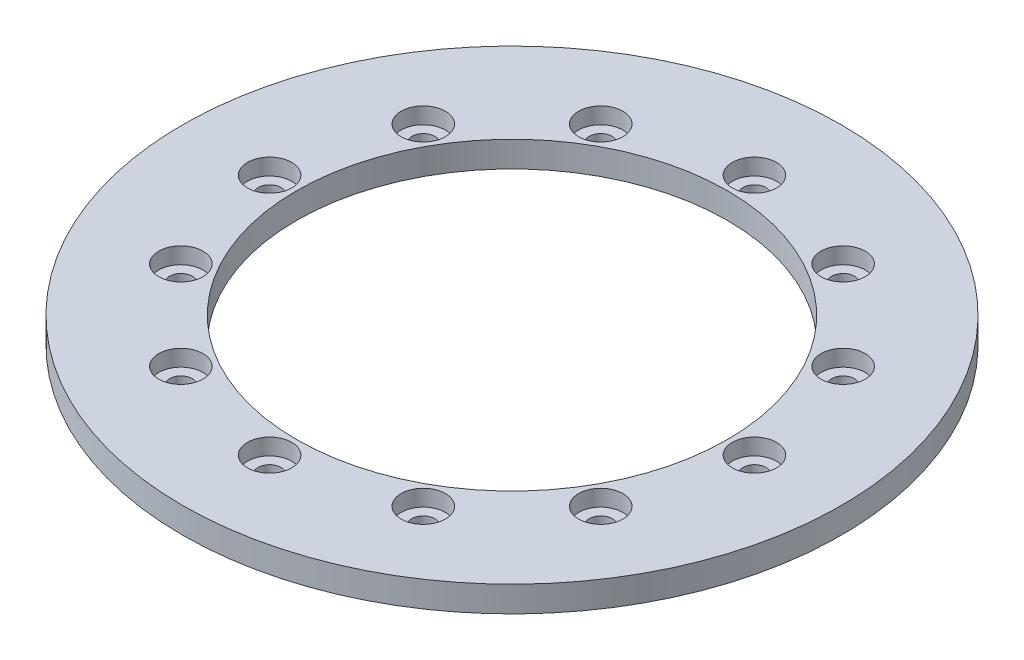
ISO-10303-21;
HEADER;
FILE_DESCRIPTION(('STEP AP214'),'2;1');
FILE_NAME('part.step','',(''),(''),'','','');
FILE_SCHEMA(('AUTOMOTIVE_DESIGN { 1 0 10303 214 1 1 1 1 }'));
ENDSEC;
DATA;
#1=APPLICATION_CONTEXT('core data for automotive mechanical design processes');
#2=APPLICATION_PROTOCOL_DEFINITION('international standard','automotive_design',2000,#1);
#3=PRODUCT_CONTEXT('',#1,'mechanical');
#4=PRODUCT('Part','Part','',(#3));
#5=PRODUCT_RELATED_PRODUCT_CATEGORY('part','',(#4));
#6=PRODUCT_DEFINITION_FORMATION('','',#4);
#7=PRODUCT_DEFINITION_CONTEXT('part definition',#1,'design');
#8=PRODUCT_DEFINITION('design','',#6,#7);
#9=PRODUCT_DEFINITION_SHAPE('','',#8);
#10=(LENGTH_UNIT() NAMED_UNIT(*) SI_UNIT(.MILLI.,.METRE.));
#11=(NAMED_UNIT(*) PLANE_ANGLE_UNIT() SI_UNIT($,.RADIAN.));
#12=(NAMED_UNIT(*) SI_UNIT($,.STERADIAN.) SOLID_ANGLE_UNIT());
#13=UNCERTAINTY_MEASURE_WITH_UNIT(LENGTH_MEASURE(1.E-05),#10,'distance_accuracy_value','');
#14=(GEOMETRIC_REPRESENTATION_CONTEXT(3) GLOBAL_UNCERTAINTY_ASSIGNED_CONTEXT((#13)) GLOBAL_UNIT_ASSIGNED_CONTEXT((#10,
#11,#12)) REPRESENTATION_CONTEXT('',''));
#15=CARTESIAN_POINT('',(0.,0.,0.));
#16=DIRECTION('',(0.,0.,1.));
#17=DIRECTION('',(1.,0.,0.));
#18=AXIS2_PLACEMENT_3D('',#15,#16,#17);
#19=CARTESIAN_POINT('',(0.,5.08,0.));
#20=DIRECTION('',(0.,1.,0.));
#21=DIRECTION('',(0.,0.,1.));
#22=AXIS2_PLACEMENT_3D('',#19,#20,#21);
#23=PLANE('',#22);
#24=CARTESIAN_POINT('',(41.4064499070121,5.08000000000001,23.9060249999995));
#25=DIRECTION('',(0.,1.,0.));
#26=DIRECTION('',(0.,0.,1.));
#27=AXIS2_PLACEMENT_3D('',#24,#25,#26);
#28=CIRCLE('',#27,4.36626);
#29=CARTESIAN_POINT('',(41.4064499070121,5.08000000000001,28.2722849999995));
#30=VERTEX_POINT('',#29);
#31=EDGE_CURVE('E196',#30,#30,#28,.T.);
#32=ORIENTED_EDGE('',*,*,#31,.F.);
#33=EDGE_LOOP('',(#32));
#34=FACE_BOUND('',#33,.T.);
#35=CARTESIAN_POINT('',(23.9060250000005,5.08000000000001,41.4064499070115));
#36=DIRECTION('',(0.,1.,0.));
#37=DIRECTION('',(0.,0.,1.));
#38=AXIS2_PLACEMENT_3D('',#35,#36,#37);
#39=CIRCLE('',#38,4.36626);
#40=CARTESIAN_POINT('',(23.9060250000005,5.08000000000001,45.7727099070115));
#41=VERTEX_POINT('',#40);
#42=EDGE_CURVE('E184',#41,#41,#39,.T.);
#43=ORIENTED_EDGE('',*,*,#42,.F.);
#44=EDGE_LOOP('',(#43));
#45=FACE_BOUND('',#44,.T.);
#46=CARTESIAN_POINT('',(4.91429621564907E-13,5.08000000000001,47.81205));
#47=DIRECTION('',(0.,1.,0.));
#48=DIRECTION('',(0.,0.,1.));
#49=AXIS2_PLACEMENT_3D('',#46,#47,#48);
#50=CIRCLE('',#49,4.36626);
#51=CARTESIAN_POINT('',(4.91429621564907E-13,5.08000000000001,52.17831));
#52=VERTEX_POINT('',#51);
#53=EDGE_CURVE('E172',#52,#52,#50,.T.);
#54=ORIENTED_EDGE('',*,*,#53,.F.);
#55=EDGE_LOOP('',(#54));
#56=FACE_BOUND('',#55,.T.);
#57=CARTESIAN_POINT('',(-23.9060249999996,5.08000000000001,41.406449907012));
#58=DIRECTION('',(0.,1.,0.));
#59=DIRECTION('',(0.,0.,1.));
#60=AXIS2_PLACEMENT_3D('',#57,#58,#59);
#61=CIRCLE('',#60,4.36626);
#62=CARTESIAN_POINT('',(-23.9060249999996,5.08000000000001,45.772709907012));
#63=VERTEX_POINT('',#62);
#64=EDGE_CURVE('E160',#63,#63,#61,.T.);
#65=ORIENTED_EDGE('',*,*,#64,.F.);
#66=EDGE_LOOP('',(#65));
#67=FACE_BOUND('',#66,.T.);
#68=CARTESIAN_POINT('',(-41.4064499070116,5.08000000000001,23.9060250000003));
#69=DIRECTION('',(0.,1.,0.));
#70=DIRECTION('',(0.,0.,1.));
#71=AXIS2_PLACEMENT_3D('',#68,#69,#70);
#72=CIRCLE('',#71,4.36626);
#73=CARTESIAN_POINT('',(-41.4064499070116,5.08000000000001,28.2722850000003));
#74=VERTEX_POINT('',#73);
#75=EDGE_CURVE('E148',#74,#74,#72,.T.);
#76=ORIENTED_EDGE('',*,*,#75,.F.);
#77=EDGE_LOOP('',(#76));
#78=FACE_BOUND('',#77,.T.);
#79=CARTESIAN_POINT('',(-47.81205,5.08,0.));
#80=DIRECTION('',(0.,1.,0.));
#81=DIRECTION('',(0.,0.,1.));
#82=AXIS2_PLACEMENT_3D('',#79,#80,#81);
#83=CIRCLE('',#82,4.36626);
#84=CARTESIAN_POINT('',(-47.81205,5.08,4.36625999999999));
#85=VERTEX_POINT('',#84);
#86=EDGE_CURVE('E136',#85,#85,#83,.T.);
#87=ORIENTED_EDGE('',*,*,#86,.F.);
#88=EDGE_LOOP('',(#87));
#89=FACE_BOUND('',#88,.T.);
#90=CARTESIAN_POINT('',(-41.4064499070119,5.07999999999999,-23.9060249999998));
#91=DIRECTION('',(0.,1.,0.));
#92=DIRECTION('',(0.,0.,1.));
#93=AXIS2_PLACEMENT_3D('',#90,#91,#92);
#94=CIRCLE('',#93,4.36626);
#95=CARTESIAN_POINT('',(-41.4064499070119,5.08,-19.5397649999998));
#96=VERTEX_POINT('',#95);
#97=EDGE_CURVE('E124',#96,#96,#94,.T.);
#98=ORIENTED_EDGE('',*,*,#97,.F.);
#99=EDGE_LOOP('',(#98));
#100=FACE_BOUND('',#99,.T.);
#101=CARTESIAN_POINT('',(-23.9060250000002,5.07999999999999,-41.4064499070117));
#102=DIRECTION('',(0.,1.,0.));
#103=DIRECTION('',(0.,0.,1.));
#104=AXIS2_PLACEMENT_3D('',#101,#102,#103);
#105=CIRCLE('',#104,4.36626);
#106=CARTESIAN_POINT('',(-23.9060250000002,5.07999999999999,-37.0401899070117));
#107=VERTEX_POINT('',#106);
#108=EDGE_CURVE('E112',#107,#107,#105,.T.);
#109=ORIENTED_EDGE('',*,*,#108,.F.);
#110=EDGE_LOOP('',(#109));
#111=FACE_BOUND('',#110,.T.);
#112=CARTESIAN_POINT('',(-1.57559860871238E-13,5.07999999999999,-47.81205));
#113=DIRECTION('',(0.,1.,0.));
#114=DIRECTION('',(0.,0.,1.));
#115=AXIS2_PLACEMENT_3D('',#112,#113,#114);
#116=CIRCLE('',#115,4.36626);
#117=CARTESIAN_POINT('',(-1.57559860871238E-13,5.07999999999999,-43.44579));
#118=VERTEX_POINT('',#117);
#119=EDGE_CURVE('E100',#118,#118,#116,.T.);
#120=ORIENTED_EDGE('',*,*,#119,.F.);
#121=EDGE_LOOP('',(#120));
#122=FACE_BOUND('',#121,.T.);
#123=CARTESIAN_POINT('',(23.9060249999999,5.07999999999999,-41.4064499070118));
#124=DIRECTION('',(0.,1.,0.));
#125=DIRECTION('',(0.,0.,1.));
#126=AXIS2_PLACEMENT_3D('',#123,#124,#125);
#127=CIRCLE('',#126,4.36626);
#128=CARTESIAN_POINT('',(23.9060249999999,5.07999999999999,-37.0401899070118));
#129=VERTEX_POINT('',#128);
#130=EDGE_CURVE('E88',#129,#129,#127,.T.);
#131=ORIENTED_EDGE('',*,*,#130,.F.);
#132=EDGE_LOOP('',(#131));
#133=FACE_BOUND('',#132,.T.);
#134=CARTESIAN_POINT('',(41.4064499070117,5.07999999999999,-23.906025));
#135=DIRECTION('',(0.,1.,0.));
#136=DIRECTION('',(0.,0.,1.));
#137=AXIS2_PLACEMENT_3D('',#134,#135,#136);
#138=CIRCLE('',#137,4.36626);
#139=CARTESIAN_POINT('',(41.4064499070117,5.07999999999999,-19.539765));
#140=VERTEX_POINT('',#139);
#141=EDGE_CURVE('E76',#140,#140,#138,.T.);
#142=ORIENTED_EDGE('',*,*,#141,.F.);
#143=EDGE_LOOP('',(#142));
#144=FACE_BOUND('',#143,.T.);
#145=CARTESIAN_POINT('',(47.81205,5.08,0.));
#146=DIRECTION('',(0.,1.,0.));
#147=DIRECTION('',(0.,0.,1.));
#148=AXIS2_PLACEMENT_3D('',#145,#146,#147);
#149=CIRCLE('',#148,4.36626);
#150=CARTESIAN_POINT('',(47.81205,5.08,4.36626000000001));
#151=VERTEX_POINT('',#150);
#152=EDGE_CURVE('E64',#151,#151,#149,.T.);
#153=ORIENTED_EDGE('',*,*,#152,.F.);
#154=EDGE_LOOP('',(#153));
#155=FACE_BOUND('',#154,.T.);
#156=CARTESIAN_POINT('',(0.,5.08,0.));
#157=DIRECTION('',(0.,1.,0.));
#158=DIRECTION('',(0.,0.,1.));
#159=AXIS2_PLACEMENT_3D('',#156,#157,#158);
#160=CIRCLE('',#159,65.);
#161=CARTESIAN_POINT('',(0.,5.08,65.));
#162=VERTEX_POINT('',#161);
#163=EDGE_CURVE('E10',#162,#162,#160,.T.);
#164=ORIENTED_EDGE('',*,*,#163,.T.);
#165=EDGE_LOOP('',(#164));
#166=FACE_BOUND('',#165,.T.);
#167=CARTESIAN_POINT('',(0.,5.08,0.));
#168=DIRECTION('',(0.,1.,0.));
#169=DIRECTION('',(0.,0.,1.));
#170=AXIS2_PLACEMENT_3D('',#167,#168,#169);
#171=CIRCLE('',#170,42.5);
#172=CARTESIAN_POINT('',(0.,5.08,42.5));
#173=VERTEX_POINT('',#172);
#174=EDGE_CURVE('E48',#173,#173,#171,.T.);
#175=ORIENTED_EDGE('',*,*,#174,.F.);
#176=EDGE_LOOP('',(#175));
#177=FACE_BOUND('',#176,.T.);
#178=ADVANCED_FACE('F35',(#34,#45,#56,#67,#78,#89,#100,#111,#122,#133,#144,#155,#166,#177),#23,.T.);
#179=CARTESIAN_POINT('',(0.,0.,0.));
#180=DIRECTION('',(0.,1.,0.));
#181=DIRECTION('',(0.,0.,1.));
#182=AXIS2_PLACEMENT_3D('',#179,#180,#181);
#183=PLANE('',#182);
#184=CARTESIAN_POINT('',(41.4064499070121,0.,23.9060249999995));
#185=DIRECTION('',(0.,1.,0.));
#186=DIRECTION('',(0.,0.,1.));
#187=AXIS2_PLACEMENT_3D('',#184,#185,#186);
#188=CIRCLE('',#187,2.2479);
#189=CARTESIAN_POINT('',(41.4064499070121,0.,26.1539249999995));
#190=VERTEX_POINT('',#189);
#191=EDGE_CURVE('E187',#190,#190,#188,.T.);
#192=ORIENTED_EDGE('',*,*,#191,.T.);
#193=EDGE_LOOP('',(#192));
#194=FACE_BOUND('',#193,.T.);
#195=CARTESIAN_POINT('',(23.9060250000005,0.,41.4064499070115));
#196=DIRECTION('',(0.,1.,0.));
#197=DIRECTION('',(0.,0.,1.));
#198=AXIS2_PLACEMENT_3D('',#195,#196,#197);
#199=CIRCLE('',#198,2.2479);
#200=CARTESIAN_POINT('',(23.9060250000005,0.,43.6543499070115));
#201=VERTEX_POINT('',#200);
#202=EDGE_CURVE('E175',#201,#201,#199,.T.);
#203=ORIENTED_EDGE('',*,*,#202,.T.);
#204=EDGE_LOOP('',(#203));
#205=FACE_BOUND('',#204,.T.);
#206=CARTESIAN_POINT('',(4.91429621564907E-13,0.,47.81205));
#207=DIRECTION('',(0.,1.,0.));
#208=DIRECTION('',(0.,0.,1.));
#209=AXIS2_PLACEMENT_3D('',#206,#207,#208);
#210=CIRCLE('',#209,2.2479);
#211=CARTESIAN_POINT('',(4.91429621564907E-13,0.,50.05995));
#212=VERTEX_POINT('',#211);
#213=EDGE_CURVE('E163',#212,#212,#210,.T.);
#214=ORIENTED_EDGE('',*,*,#213,.T.);
#215=EDGE_LOOP('',(#214));
#216=FACE_BOUND('',#215,.T.);
#217=CARTESIAN_POINT('',(-23.9060249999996,0.,41.406449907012));
#218=DIRECTION('',(0.,1.,0.));
#219=DIRECTION('',(0.,0.,1.));
#220=AXIS2_PLACEMENT_3D('',#217,#218,#219);
#221=CIRCLE('',#220,2.2479);
#222=CARTESIAN_POINT('',(-23.9060249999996,0.,43.654349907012));
#223=VERTEX_POINT('',#222);
#224=EDGE_CURVE('E151',#223,#223,#221,.T.);
#225=ORIENTED_EDGE('',*,*,#224,.T.);
#226=EDGE_LOOP('',(#225));
#227=FACE_BOUND('',#226,.T.);
#228=CARTESIAN_POINT('',(-41.4064499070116,0.,23.9060250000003));
#229=DIRECTION('',(0.,1.,0.));
#230=DIRECTION('',(0.,0.,1.));
#231=AXIS2_PLACEMENT_3D('',#228,#229,#230);
#232=CIRCLE('',#231,2.2479);
#233=CARTESIAN_POINT('',(-41.4064499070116,0.,26.1539250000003));
#234=VERTEX_POINT('',#233);
#235=EDGE_CURVE('E139',#234,#234,#232,.T.);
#236=ORIENTED_EDGE('',*,*,#235,.T.);
#237=EDGE_LOOP('',(#236));
#238=FACE_BOUND('',#237,.T.);
#239=CARTESIAN_POINT('',(-47.81205,0.,0.));
#240=DIRECTION('',(0.,1.,0.));
#241=DIRECTION('',(0.,0.,1.));
#242=AXIS2_PLACEMENT_3D('',#239,#240,#241);
#243=CIRCLE('',#242,2.2479);
#244=CARTESIAN_POINT('',(-47.81205,0.,2.24789999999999));
#245=VERTEX_POINT('',#244);
#246=EDGE_CURVE('E127',#245,#245,#243,.T.);
#247=ORIENTED_EDGE('',*,*,#246,.T.);
#248=EDGE_LOOP('',(#247));
#249=FACE_BOUND('',#248,.T.);
#250=CARTESIAN_POINT('',(-41.4064499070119,0.,-23.9060249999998));
#251=DIRECTION('',(0.,1.,0.));
#252=DIRECTION('',(0.,0.,1.));
#253=AXIS2_PLACEMENT_3D('',#250,#251,#252);
#254=CIRCLE('',#253,2.2479);
#255=CARTESIAN_POINT('',(-41.4064499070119,0.,-21.6581249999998));
#256=VERTEX_POINT('',#255);
#257=EDGE_CURVE('E115',#256,#256,#254,.T.);
#258=ORIENTED_EDGE('',*,*,#257,.T.);
#259=EDGE_LOOP('',(#258));
#260=FACE_BOUND('',#259,.T.);
#261=CARTESIAN_POINT('',(-23.9060250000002,0.,-41.4064499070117));
#262=DIRECTION('',(0.,1.,0.));
#263=DIRECTION('',(0.,0.,1.));
#264=AXIS2_PLACEMENT_3D('',#261,#262,#263);
#265=CIRCLE('',#264,2.2479);
#266=CARTESIAN_POINT('',(-23.9060250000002,0.,-39.1585499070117));
#267=VERTEX_POINT('',#266);
#268=EDGE_CURVE('E103',#267,#267,#265,.T.);
#269=ORIENTED_EDGE('',*,*,#268,.T.);
#270=EDGE_LOOP('',(#269));
#271=FACE_BOUND('',#270,.T.);
#272=CARTESIAN_POINT('',(-1.57559860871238E-13,0.,-47.81205));
#273=DIRECTION('',(0.,1.,0.));
#274=DIRECTION('',(0.,0.,1.));
#275=AXIS2_PLACEMENT_3D('',#272,#273,#274);
#276=CIRCLE('',#275,2.2479);
#277=CARTESIAN_POINT('',(-1.57559860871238E-13,0.,-45.56415));
#278=VERTEX_POINT('',#277);
#279=EDGE_CURVE('E91',#278,#278,#276,.T.);
#280=ORIENTED_EDGE('',*,*,#279,.T.);
#281=EDGE_LOOP('',(#280));
#282=FACE_BOUND('',#281,.T.);
#283=CARTESIAN_POINT('',(23.9060249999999,0.,-41.4064499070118));
#284=DIRECTION('',(0.,1.,0.));
#285=DIRECTION('',(0.,0.,1.));
#286=AXIS2_PLACEMENT_3D('',#283,#284,#285);
#287=CIRCLE('',#286,2.2479);
#288=CARTESIAN_POINT('',(23.9060249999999,0.,-39.1585499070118));
#289=VERTEX_POINT('',#288);
#290=EDGE_CURVE('E79',#289,#289,#287,.T.);
#291=ORIENTED_EDGE('',*,*,#290,.T.);
#292=EDGE_LOOP('',(#291));
#293=FACE_BOUND('',#292,.T.);
#294=CARTESIAN_POINT('',(41.4064499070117,0.,-23.906025));
#295=DIRECTION('',(0.,1.,0.));
#296=DIRECTION('',(0.,0.,1.));
#297=AXIS2_PLACEMENT_3D('',#294,#295,#296);
#298=CIRCLE('',#297,2.2479);
#299=CARTESIAN_POINT('',(41.4064499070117,0.,-21.658125));
#300=VERTEX_POINT('',#299);
#301=EDGE_CURVE('E67',#300,#300,#298,.T.);
#302=ORIENTED_EDGE('',*,*,#301,.T.);
#303=EDGE_LOOP('',(#302));
#304=FACE_BOUND('',#303,.T.);
#305=CARTESIAN_POINT('',(47.81205,0.,0.));
#306=DIRECTION('',(0.,1.,0.));
#307=DIRECTION('',(0.,0.,1.));
#308=AXIS2_PLACEMENT_3D('',#305,#306,#307);
#309=CIRCLE('',#308,2.2479);
#310=CARTESIAN_POINT('',(47.81205,0.,2.24790000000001));
#311=VERTEX_POINT('',#310);
#312=EDGE_CURVE('E53',#311,#311,#309,.T.);
#313=ORIENTED_EDGE('',*,*,#312,.T.);
#314=EDGE_LOOP('',(#313));
#315=FACE_BOUND('',#314,.T.);
#316=CARTESIAN_POINT('',(0.,0.,0.));
#317=DIRECTION('',(0.,1.,0.));
#318=DIRECTION('',(0.,0.,1.));
#319=AXIS2_PLACEMENT_3D('',#316,#317,#318);
#320=CIRCLE('',#319,65.);
#321=CARTESIAN_POINT('',(0.,0.,65.));
#322=VERTEX_POINT('',#321);
#323=EDGE_CURVE('E39',#322,#322,#320,.T.);
#324=ORIENTED_EDGE('',*,*,#323,.F.);
#325=EDGE_LOOP('',(#324));
#326=FACE_BOUND('',#325,.T.);
#327=CARTESIAN_POINT('',(0.,0.,0.));
#328=DIRECTION('',(0.,1.,0.));
#329=DIRECTION('',(0.,0.,1.));
#330=AXIS2_PLACEMENT_3D('',#327,#328,#329);
#331=CIRCLE('',#330,42.5);
#332=CARTESIAN_POINT('',(0.,0.,42.5));
#333=VERTEX_POINT('',#332);
#334=EDGE_CURVE('E50',#333,#333,#331,.T.);
#335=ORIENTED_EDGE('',*,*,#334,.T.);
#336=EDGE_LOOP('',(#335));
#337=FACE_BOUND('',#336,.T.);
#338=ADVANCED_FACE('F204',(#194,#205,#216,#227,#238,#249,#260,#271,#282,#293,#304,#315,#326,
#337),#183,.F.);
#339=CARTESIAN_POINT('',(0.,5.08,0.));
#340=DIRECTION('',(0.,-1.,0.));
#341=DIRECTION('',(0.,0.,-1.));
#342=AXIS2_PLACEMENT_3D('',#339,#340,#341);
#343=CYLINDRICAL_SURFACE('',#342,65.);
#344=ORIENTED_EDGE('',*,*,#163,.F.);
#345=EDGE_LOOP('',(#344));
#346=FACE_BOUND('',#345,.T.);
#347=ORIENTED_EDGE('',*,*,#323,.T.);
#348=EDGE_LOOP('',(#347));
#349=FACE_BOUND('',#348,.T.);
#350=ADVANCED_FACE('F37',(#346,#349),#343,.T.);
#351=CARTESIAN_POINT('',(0.,5.08,0.));
#352=DIRECTION('',(0.,-1.,0.));
#353=DIRECTION('',(0.,0.,-1.));
#354=AXIS2_PLACEMENT_3D('',#351,#352,#353);
#355=CYLINDRICAL_SURFACE('',#354,42.5);
#356=ORIENTED_EDGE('',*,*,#174,.T.);
#357=EDGE_LOOP('',(#356));
#358=FACE_BOUND('',#357,.T.);
#359=ORIENTED_EDGE('',*,*,#334,.F.);
#360=EDGE_LOOP('',(#359));
#361=FACE_BOUND('',#360,.T.);
#362=ADVANCED_FACE('F230',(#358,#361),#355,.F.);
#363=CARTESIAN_POINT('',(47.81205,5.08,0.));
#364=DIRECTION('',(0.,1.,0.));
#365=DIRECTION('',(0.,0.,1.));
#366=AXIS2_PLACEMENT_3D('',#363,#364,#365);
#367=CYLINDRICAL_SURFACE('',#366,2.2479);
#368=ORIENTED_EDGE('',*,*,#312,.F.);
#369=EDGE_LOOP('',(#368));
#370=FACE_BOUND('',#369,.T.);
#371=CARTESIAN_POINT('',(47.81205,1.8542,0.));
#372=DIRECTION('',(0.,1.,0.));
#373=DIRECTION('',(0.,0.,1.));
#374=AXIS2_PLACEMENT_3D('',#371,#372,#373);
#375=CIRCLE('',#374,2.2479);
#376=CARTESIAN_POINT('',(47.81205,1.8542,2.24790000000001));
#377=VERTEX_POINT('',#376);
#378=EDGE_CURVE('E58',#377,#377,#375,.T.);
#379=ORIENTED_EDGE('',*,*,#378,.T.);
#380=EDGE_LOOP('',(#379));
#381=FACE_BOUND('',#380,.T.);
#382=ADVANCED_FACE('F233',(#370,#381),#367,.F.);
#383=CARTESIAN_POINT('',(50.05995,1.8542,0.));
#384=DIRECTION('',(0.,-1.,0.));
#385=DIRECTION('',(0.,0.,-1.));
#386=AXIS2_PLACEMENT_3D('',#383,#384,#385);
#387=PLANE('',#386);
#388=ORIENTED_EDGE('',*,*,#378,.F.);
#389=EDGE_LOOP('',(#388));
#390=FACE_BOUND('',#389,.T.);
#391=CARTESIAN_POINT('',(47.81205,1.8542,0.));
#392=DIRECTION('',(0.,1.,0.));
#393=DIRECTION('',(0.,0.,1.));
#394=AXIS2_PLACEMENT_3D('',#391,#392,#393);
#395=CIRCLE('',#394,4.36626);
#396=CARTESIAN_POINT('',(47.81205,1.8542,4.36626000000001));
#397=VERTEX_POINT('',#396);
#398=EDGE_CURVE('E61',#397,#397,#395,.T.);
#399=ORIENTED_EDGE('',*,*,#398,.T.);
#400=EDGE_LOOP('',(#399));
#401=FACE_BOUND('',#400,.T.);
#402=ADVANCED_FACE('F247',(#390,#401),#387,.F.);
#403=CARTESIAN_POINT('',(47.81205,5.08,0.));
#404=DIRECTION('',(0.,1.,0.));
#405=DIRECTION('',(0.,0.,1.));
#406=AXIS2_PLACEMENT_3D('',#403,#404,#405);
#407=CYLINDRICAL_SURFACE('',#406,4.36626);
#408=ORIENTED_EDGE('',*,*,#398,.F.);
#409=EDGE_LOOP('',(#408));
#410=FACE_BOUND('',#409,.T.);
#411=ORIENTED_EDGE('',*,*,#152,.T.);
#412=EDGE_LOOP('',(#411));
#413=FACE_BOUND('',#412,.T.);
#414=ADVANCED_FACE('F251',(#410,#413),#407,.F.);
#415=CARTESIAN_POINT('',(41.4064499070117,5.07999999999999,-23.906025));
#416=DIRECTION('',(0.,1.,0.));
#417=DIRECTION('',(0.,0.,1.));
#418=AXIS2_PLACEMENT_3D('',#415,#416,#417);
#419=CYLINDRICAL_SURFACE('',#418,2.2479);
#420=ORIENTED_EDGE('',*,*,#301,.F.);
#421=EDGE_LOOP('',(#420));
#422=FACE_BOUND('',#421,.T.);
#423=CARTESIAN_POINT('',(41.4064499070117,1.8542,-23.906025));
#424=DIRECTION('',(0.,1.,0.));
#425=DIRECTION('',(0.,0.,1.));
#426=AXIS2_PLACEMENT_3D('',#423,#424,#425);
#427=CIRCLE('',#426,2.2479);
#428=CARTESIAN_POINT('',(41.4064499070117,1.8542,-21.658125));
#429=VERTEX_POINT('',#428);
#430=EDGE_CURVE('E70',#429,#429,#427,.T.);
#431=ORIENTED_EDGE('',*,*,#430,.T.);
#432=EDGE_LOOP('',(#431));
#433=FACE_BOUND('',#432,.T.);
#434=ADVANCED_FACE('F255',(#422,#433),#419,.F.);
#435=CARTESIAN_POINT('',(43.6543499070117,1.8542,-23.906025));
#436=DIRECTION('',(0.,-1.,0.));
#437=DIRECTION('',(0.,0.,-1.));
#438=AXIS2_PLACEMENT_3D('',#435,#436,#437);
#439=PLANE('',#438);
#440=ORIENTED_EDGE('',*,*,#430,.F.);
#441=EDGE_LOOP('',(#440));
#442=FACE_BOUND('',#441,.T.);
#443=CARTESIAN_POINT('',(41.4064499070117,1.8542,-23.906025));
#444=DIRECTION('',(0.,1.,0.));
#445=DIRECTION('',(0.,0.,1.));
#446=AXIS2_PLACEMENT_3D('',#443,#444,#445);
#447=CIRCLE('',#446,4.36626);
#448=CARTESIAN_POINT('',(41.4064499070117,1.8542,-19.539765));
#449=VERTEX_POINT('',#448);
#450=EDGE_CURVE('E73',#449,#449,#447,.T.);
#451=ORIENTED_EDGE('',*,*,#450,.T.);
#452=EDGE_LOOP('',(#451));
#453=FACE_BOUND('',#452,.T.);
#454=ADVANCED_FACE('F259',(#442,#453),#439,.F.);
#455=CARTESIAN_POINT('',(41.4064499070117,5.07999999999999,-23.906025));
#456=DIRECTION('',(0.,1.,0.));
#457=DIRECTION('',(0.,0.,1.));
#458=AXIS2_PLACEMENT_3D('',#455,#456,#457);
#459=CYLINDRICAL_SURFACE('',#458,4.36626);
#460=ORIENTED_EDGE('',*,*,#450,.F.);
#461=EDGE_LOOP('',(#460));
#462=FACE_BOUND('',#461,.T.);
#463=ORIENTED_EDGE('',*,*,#141,.T.);
#464=EDGE_LOOP('',(#463));
#465=FACE_BOUND('',#464,.T.);
#466=ADVANCED_FACE('F263',(#462,#465),#459,.F.);
#467=CARTESIAN_POINT('',(23.9060249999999,5.07999999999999,-41.4064499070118));
#468=DIRECTION('',(0.,1.,0.));
#469=DIRECTION('',(0.,0.,1.));
#470=AXIS2_PLACEMENT_3D('',#467,#468,#469);
#471=CYLINDRICAL_SURFACE('',#470,2.2479);
#472=ORIENTED_EDGE('',*,*,#290,.F.);
#473=EDGE_LOOP('',(#472));
#474=FACE_BOUND('',#473,.T.);
#475=CARTESIAN_POINT('',(23.9060249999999,1.85419999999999,-41.4064499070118));
#476=DIRECTION('',(0.,1.,0.));
#477=DIRECTION('',(0.,0.,1.));
#478=AXIS2_PLACEMENT_3D('',#475,#476,#477);
#479=CIRCLE('',#478,2.2479);
#480=CARTESIAN_POINT('',(23.9060249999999,1.85419999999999,-39.1585499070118));
#481=VERTEX_POINT('',#480);
#482=EDGE_CURVE('E82',#481,#481,#479,.T.);
#483=ORIENTED_EDGE('',*,*,#482,.T.);
#484=EDGE_LOOP('',(#483));
#485=FACE_BOUND('',#484,.T.);
#486=ADVANCED_FACE('F267',(#474,#485),#471,.F.);
#487=CARTESIAN_POINT('',(26.1539249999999,1.85419999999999,-41.4064499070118));
#488=DIRECTION('',(0.,-1.,0.));
#489=DIRECTION('',(0.,0.,-1.));
#490=AXIS2_PLACEMENT_3D('',#487,#488,#489);
#491=PLANE('',#490);
#492=ORIENTED_EDGE('',*,*,#482,.F.);
#493=EDGE_LOOP('',(#492));
#494=FACE_BOUND('',#493,.T.);
#495=CARTESIAN_POINT('',(23.9060249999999,1.85419999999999,-41.4064499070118));
#496=DIRECTION('',(0.,1.,0.));
#497=DIRECTION('',(0.,0.,1.));
#498=AXIS2_PLACEMENT_3D('',#495,#496,#497);
#499=CIRCLE('',#498,4.36626);
#500=CARTESIAN_POINT('',(23.9060249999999,1.85419999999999,-37.0401899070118));
#501=VERTEX_POINT('',#500);
#502=EDGE_CURVE('E85',#501,#501,#499,.T.);
#503=ORIENTED_EDGE('',*,*,#502,.T.);
#504=EDGE_LOOP('',(#503));
#505=FACE_BOUND('',#504,.T.);
#506=ADVANCED_FACE('F271',(#494,#505),#491,.F.);
#507=CARTESIAN_POINT('',(23.9060249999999,5.07999999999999,-41.4064499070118));
#508=DIRECTION('',(0.,1.,0.));
#509=DIRECTION('',(0.,0.,1.));
#510=AXIS2_PLACEMENT_3D('',#507,#508,#509);
#511=CYLINDRICAL_SURFACE('',#510,4.36626);
#512=ORIENTED_EDGE('',*,*,#502,.F.);
#513=EDGE_LOOP('',(#512));
#514=FACE_BOUND('',#513,.T.);
#515=ORIENTED_EDGE('',*,*,#130,.T.);
#516=EDGE_LOOP('',(#515));
#517=FACE_BOUND('',#516,.T.);
#518=ADVANCED_FACE('F275',(#514,#517),#511,.F.);
#519=CARTESIAN_POINT('',(-1.57559860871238E-13,5.07999999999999,-47.81205));
#520=DIRECTION('',(0.,1.,0.));
#521=DIRECTION('',(0.,0.,1.));
#522=AXIS2_PLACEMENT_3D('',#519,#520,#521);
#523=CYLINDRICAL_SURFACE('',#522,2.2479);
#524=ORIENTED_EDGE('',*,*,#279,.F.);
#525=EDGE_LOOP('',(#524));
#526=FACE_BOUND('',#525,.T.);
#527=CARTESIAN_POINT('',(-1.57559860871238E-13,1.85419999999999,-47.81205));
#528=DIRECTION('',(0.,1.,0.));
#529=DIRECTION('',(0.,0.,1.));
#530=AXIS2_PLACEMENT_3D('',#527,#528,#529);
#531=CIRCLE('',#530,2.2479);
#532=CARTESIAN_POINT('',(-1.57559860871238E-13,1.85419999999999,-45.56415));
#533=VERTEX_POINT('',#532);
#534=EDGE_CURVE('E94',#533,#533,#531,.T.);
#535=ORIENTED_EDGE('',*,*,#534,.T.);
#536=EDGE_LOOP('',(#535));
#537=FACE_BOUND('',#536,.T.);
#538=ADVANCED_FACE('F279',(#526,#537),#523,.F.);
#539=CARTESIAN_POINT('',(2.24789999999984,1.85419999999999,-47.81205));
#540=DIRECTION('',(0.,-1.,0.));
#541=DIRECTION('',(0.,0.,-1.));
#542=AXIS2_PLACEMENT_3D('',#539,#540,#541);
#543=PLANE('',#542);
#544=ORIENTED_EDGE('',*,*,#534,.F.);
#545=EDGE_LOOP('',(#544));
#546=FACE_BOUND('',#545,.T.);
#547=CARTESIAN_POINT('',(-1.57559860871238E-13,1.85419999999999,-47.81205));
#548=DIRECTION('',(0.,1.,0.));
#549=DIRECTION('',(0.,0.,1.));
#550=AXIS2_PLACEMENT_3D('',#547,#548,#549);
#551=CIRCLE('',#550,4.36626);
#552=CARTESIAN_POINT('',(-1.57559860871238E-13,1.85419999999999,-43.44579));
#553=VERTEX_POINT('',#552);
#554=EDGE_CURVE('E97',#553,#553,#551,.T.);
#555=ORIENTED_EDGE('',*,*,#554,.T.);
#556=EDGE_LOOP('',(#555));
#557=FACE_BOUND('',#556,.T.);
#558=ADVANCED_FACE('F283',(#546,#557),#543,.F.);
#559=CARTESIAN_POINT('',(-1.57559860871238E-13,5.07999999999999,-47.81205));
#560=DIRECTION('',(0.,1.,0.));
#561=DIRECTION('',(0.,0.,1.));
#562=AXIS2_PLACEMENT_3D('',#559,#560,#561);
#563=CYLINDRICAL_SURFACE('',#562,4.36626);
#564=ORIENTED_EDGE('',*,*,#554,.F.);
#565=EDGE_LOOP('',(#564));
#566=FACE_BOUND('',#565,.T.);
#567=ORIENTED_EDGE('',*,*,#119,.T.);
#568=EDGE_LOOP('',(#567));
#569=FACE_BOUND('',#568,.T.);
#570=ADVANCED_FACE('F287',(#566,#569),#563,.F.);
#571=CARTESIAN_POINT('',(-23.9060250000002,5.07999999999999,-41.4064499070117));
#572=DIRECTION('',(0.,1.,0.));
#573=DIRECTION('',(0.,0.,1.));
#574=AXIS2_PLACEMENT_3D('',#571,#572,#573);
#575=CYLINDRICAL_SURFACE('',#574,2.2479);
#576=ORIENTED_EDGE('',*,*,#268,.F.);
#577=EDGE_LOOP('',(#576));
#578=FACE_BOUND('',#577,.T.);
#579=CARTESIAN_POINT('',(-23.9060250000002,1.85419999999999,-41.4064499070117));
#580=DIRECTION('',(0.,1.,0.));
#581=DIRECTION('',(0.,0.,1.));
#582=AXIS2_PLACEMENT_3D('',#579,#580,#581);
#583=CIRCLE('',#582,2.2479);
#584=CARTESIAN_POINT('',(-23.9060250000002,1.85419999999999,-39.1585499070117));
#585=VERTEX_POINT('',#584);
#586=EDGE_CURVE('E106',#585,#585,#583,.T.);
#587=ORIENTED_EDGE('',*,*,#586,.T.);
#588=EDGE_LOOP('',(#587));
#589=FACE_BOUND('',#588,.T.);
#590=ADVANCED_FACE('F291',(#578,#589),#575,.F.);
#591=CARTESIAN_POINT('',(-21.6581250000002,1.85419999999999,-41.4064499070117));
#592=DIRECTION('',(0.,-1.,0.));
#593=DIRECTION('',(0.,0.,-1.));
#594=AXIS2_PLACEMENT_3D('',#591,#592,#593);
#595=PLANE('',#594);
#596=ORIENTED_EDGE('',*,*,#586,.F.);
#597=EDGE_LOOP('',(#596));
#598=FACE_BOUND('',#597,.T.);
#599=CARTESIAN_POINT('',(-23.9060250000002,1.85419999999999,-41.4064499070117));
#600=DIRECTION('',(0.,1.,0.));
#601=DIRECTION('',(0.,0.,1.));
#602=AXIS2_PLACEMENT_3D('',#599,#600,#601);
#603=CIRCLE('',#602,4.36626);
#604=CARTESIAN_POINT('',(-23.9060250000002,1.85419999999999,-37.0401899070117));
#605=VERTEX_POINT('',#604);
#606=EDGE_CURVE('E109',#605,#605,#603,.T.);
#607=ORIENTED_EDGE('',*,*,#606,.T.);
#608=EDGE_LOOP('',(#607));
#609=FACE_BOUND('',#608,.T.);
#610=ADVANCED_FACE('F295',(#598,#609),#595,.F.);
#611=CARTESIAN_POINT('',(-23.9060250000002,5.07999999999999,-41.4064499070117));
#612=DIRECTION('',(0.,1.,0.));
#613=DIRECTION('',(0.,0.,1.));
#614=AXIS2_PLACEMENT_3D('',#611,#612,#613);
#615=CYLINDRICAL_SURFACE('',#614,4.36626);
#616=ORIENTED_EDGE('',*,*,#606,.F.);
#617=EDGE_LOOP('',(#616));
#618=FACE_BOUND('',#617,.T.);
#619=ORIENTED_EDGE('',*,*,#108,.T.);
#620=EDGE_LOOP('',(#619));
#621=FACE_BOUND('',#620,.T.);
#622=ADVANCED_FACE('F299',(#618,#621),#615,.F.);
#623=CARTESIAN_POINT('',(-41.4064499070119,5.07999999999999,-23.9060249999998));
#624=DIRECTION('',(0.,1.,0.));
#625=DIRECTION('',(0.,0.,1.));
#626=AXIS2_PLACEMENT_3D('',#623,#624,#625);
#627=CYLINDRICAL_SURFACE('',#626,2.2479);
#628=ORIENTED_EDGE('',*,*,#257,.F.);
#629=EDGE_LOOP('',(#628));
#630=FACE_BOUND('',#629,.T.);
#631=CARTESIAN_POINT('',(-41.4064499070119,1.8542,-23.9060249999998));
#632=DIRECTION('',(0.,1.,0.));
#633=DIRECTION('',(0.,0.,1.));
#634=AXIS2_PLACEMENT_3D('',#631,#632,#633);
#635=CIRCLE('',#634,2.2479);
#636=CARTESIAN_POINT('',(-41.4064499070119,1.8542,-21.6581249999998));
#637=VERTEX_POINT('',#636);
#638=EDGE_CURVE('E118',#637,#637,#635,.T.);
#639=ORIENTED_EDGE('',*,*,#638,.T.);
#640=EDGE_LOOP('',(#639));
#641=FACE_BOUND('',#640,.T.);
#642=ADVANCED_FACE('F303',(#630,#641),#627,.F.);
#643=CARTESIAN_POINT('',(-39.1585499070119,1.8542,-23.9060249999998));
#644=DIRECTION('',(0.,-1.,0.));
#645=DIRECTION('',(0.,0.,-1.));
#646=AXIS2_PLACEMENT_3D('',#643,#644,#645);
#647=PLANE('',#646);
#648=ORIENTED_EDGE('',*,*,#638,.F.);
#649=EDGE_LOOP('',(#648));
#650=FACE_BOUND('',#649,.T.);
#651=CARTESIAN_POINT('',(-41.4064499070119,1.8542,-23.9060249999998));
#652=DIRECTION('',(0.,1.,0.));
#653=DIRECTION('',(0.,0.,1.));
#654=AXIS2_PLACEMENT_3D('',#651,#652,#653);
#655=CIRCLE('',#654,4.36626);
#656=CARTESIAN_POINT('',(-41.4064499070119,1.8542,-19.5397649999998));
#657=VERTEX_POINT('',#656);
#658=EDGE_CURVE('E121',#657,#657,#655,.T.);
#659=ORIENTED_EDGE('',*,*,#658,.T.);
#660=EDGE_LOOP('',(#659));
#661=FACE_BOUND('',#660,.T.);
#662=ADVANCED_FACE('F307',(#650,#661),#647,.F.);
#663=CARTESIAN_POINT('',(-41.4064499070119,5.07999999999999,-23.9060249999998));
#664=DIRECTION('',(0.,1.,0.));
#665=DIRECTION('',(0.,0.,1.));
#666=AXIS2_PLACEMENT_3D('',#663,#664,#665);
#667=CYLINDRICAL_SURFACE('',#666,4.36626);
#668=ORIENTED_EDGE('',*,*,#658,.F.);
#669=EDGE_LOOP('',(#668));
#670=FACE_BOUND('',#669,.T.);
#671=ORIENTED_EDGE('',*,*,#97,.T.);
#672=EDGE_LOOP('',(#671));
#673=FACE_BOUND('',#672,.T.);
#674=ADVANCED_FACE('F311',(#670,#673),#667,.F.);
#675=CARTESIAN_POINT('',(-47.81205,5.08,0.));
#676=DIRECTION('',(0.,1.,0.));
#677=DIRECTION('',(0.,0.,1.));
#678=AXIS2_PLACEMENT_3D('',#675,#676,#677);
#679=CYLINDRICAL_SURFACE('',#678,2.2479);
#680=ORIENTED_EDGE('',*,*,#246,.F.);
#681=EDGE_LOOP('',(#680));
#682=FACE_BOUND('',#681,.T.);
#683=CARTESIAN_POINT('',(-47.81205,1.8542,0.));
#684=DIRECTION('',(0.,1.,0.));
#685=DIRECTION('',(0.,0.,1.));
#686=AXIS2_PLACEMENT_3D('',#683,#684,#685);
#687=CIRCLE('',#686,2.2479);
#688=CARTESIAN_POINT('',(-47.81205,1.8542,2.24789999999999));
#689=VERTEX_POINT('',#688);
#690=EDGE_CURVE('E130',#689,#689,#687,.T.);
#691=ORIENTED_EDGE('',*,*,#690,.T.);
#692=EDGE_LOOP('',(#691));
#693=FACE_BOUND('',#692,.T.);
#694=ADVANCED_FACE('F315',(#682,#693),#679,.F.);
#695=CARTESIAN_POINT('',(-45.56415,1.8542,0.));
#696=DIRECTION('',(0.,-1.,0.));
#697=DIRECTION('',(0.,0.,-1.));
#698=AXIS2_PLACEMENT_3D('',#695,#696,#697);
#699=PLANE('',#698);
#700=ORIENTED_EDGE('',*,*,#690,.F.);
#701=EDGE_LOOP('',(#700));
#702=FACE_BOUND('',#701,.T.);
#703=CARTESIAN_POINT('',(-47.81205,1.8542,0.));
#704=DIRECTION('',(0.,1.,0.));
#705=DIRECTION('',(0.,0.,1.));
#706=AXIS2_PLACEMENT_3D('',#703,#704,#705);
#707=CIRCLE('',#706,4.36626);
#708=CARTESIAN_POINT('',(-47.81205,1.8542,4.36625999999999));
#709=VERTEX_POINT('',#708);
#710=EDGE_CURVE('E133',#709,#709,#707,.T.);
#711=ORIENTED_EDGE('',*,*,#710,.T.);
#712=EDGE_LOOP('',(#711));
#713=FACE_BOUND('',#712,.T.);
#714=ADVANCED_FACE('F319',(#702,#713),#699,.F.);
#715=CARTESIAN_POINT('',(-47.81205,5.08,0.));
#716=DIRECTION('',(0.,1.,0.));
#717=DIRECTION('',(0.,0.,1.));
#718=AXIS2_PLACEMENT_3D('',#715,#716,#717);
#719=CYLINDRICAL_SURFACE('',#718,4.36626);
#720=ORIENTED_EDGE('',*,*,#710,.F.);
#721=EDGE_LOOP('',(#720));
#722=FACE_BOUND('',#721,.T.);
#723=ORIENTED_EDGE('',*,*,#86,.T.);
#724=EDGE_LOOP('',(#723));
#725=FACE_BOUND('',#724,.T.);
#726=ADVANCED_FACE('F323',(#722,#725),#719,.F.);
#727=CARTESIAN_POINT('',(-41.4064499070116,5.08000000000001,23.9060250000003));
#728=DIRECTION('',(0.,1.,0.));
#729=DIRECTION('',(0.,0.,1.));
#730=AXIS2_PLACEMENT_3D('',#727,#728,#729);
#731=CYLINDRICAL_SURFACE('',#730,2.2479);
#732=ORIENTED_EDGE('',*,*,#235,.F.);
#733=EDGE_LOOP('',(#732));
#734=FACE_BOUND('',#733,.T.);
#735=CARTESIAN_POINT('',(-41.4064499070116,1.85420000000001,23.9060250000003));
#736=DIRECTION('',(0.,1.,0.));
#737=DIRECTION('',(0.,0.,1.));
#738=AXIS2_PLACEMENT_3D('',#735,#736,#737);
#739=CIRCLE('',#738,2.2479);
#740=CARTESIAN_POINT('',(-41.4064499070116,1.85420000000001,26.1539250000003));
#741=VERTEX_POINT('',#740);
#742=EDGE_CURVE('E142',#741,#741,#739,.T.);
#743=ORIENTED_EDGE('',*,*,#742,.T.);
#744=EDGE_LOOP('',(#743));
#745=FACE_BOUND('',#744,.T.);
#746=ADVANCED_FACE('F327',(#734,#745),#731,.F.);
#747=CARTESIAN_POINT('',(-39.1585499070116,1.85420000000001,23.9060250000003));
#748=DIRECTION('',(0.,-1.,0.));
#749=DIRECTION('',(0.,0.,-1.));
#750=AXIS2_PLACEMENT_3D('',#747,#748,#749);
#751=PLANE('',#750);
#752=ORIENTED_EDGE('',*,*,#742,.F.);
#753=EDGE_LOOP('',(#752));
#754=FACE_BOUND('',#753,.T.);
#755=CARTESIAN_POINT('',(-41.4064499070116,1.85420000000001,23.9060250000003));
#756=DIRECTION('',(0.,1.,0.));
#757=DIRECTION('',(0.,0.,1.));
#758=AXIS2_PLACEMENT_3D('',#755,#756,#757);
#759=CIRCLE('',#758,4.36626);
#760=CARTESIAN_POINT('',(-41.4064499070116,1.85420000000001,28.2722850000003));
#761=VERTEX_POINT('',#760);
#762=EDGE_CURVE('E145',#761,#761,#759,.T.);
#763=ORIENTED_EDGE('',*,*,#762,.T.);
#764=EDGE_LOOP('',(#763));
#765=FACE_BOUND('',#764,.T.);
#766=ADVANCED_FACE('F331',(#754,#765),#751,.F.);
#767=CARTESIAN_POINT('',(-41.4064499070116,5.08000000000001,23.9060250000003));
#768=DIRECTION('',(0.,1.,0.));
#769=DIRECTION('',(0.,0.,1.));
#770=AXIS2_PLACEMENT_3D('',#767,#768,#769);
#771=CYLINDRICAL_SURFACE('',#770,4.36626);
#772=ORIENTED_EDGE('',*,*,#762,.F.);
#773=EDGE_LOOP('',(#772));
#774=FACE_BOUND('',#773,.T.);
#775=ORIENTED_EDGE('',*,*,#75,.T.);
#776=EDGE_LOOP('',(#775));
#777=FACE_BOUND('',#776,.T.);
#778=ADVANCED_FACE('F335',(#774,#777),#771,.F.);
#779=CARTESIAN_POINT('',(-23.9060249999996,5.08000000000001,41.406449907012));
#780=DIRECTION('',(0.,1.,0.));
#781=DIRECTION('',(0.,0.,1.));
#782=AXIS2_PLACEMENT_3D('',#779,#780,#781);
#783=CYLINDRICAL_SURFACE('',#782,2.2479);
#784=ORIENTED_EDGE('',*,*,#224,.F.);
#785=EDGE_LOOP('',(#784));
#786=FACE_BOUND('',#785,.T.);
#787=CARTESIAN_POINT('',(-23.9060249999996,1.85420000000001,41.406449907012));
#788=DIRECTION('',(0.,1.,0.));
#789=DIRECTION('',(0.,0.,1.));
#790=AXIS2_PLACEMENT_3D('',#787,#788,#789);
#791=CIRCLE('',#790,2.2479);
#792=CARTESIAN_POINT('',(-23.9060249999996,1.85420000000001,43.654349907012));
#793=VERTEX_POINT('',#792);
#794=EDGE_CURVE('E154',#793,#793,#791,.T.);
#795=ORIENTED_EDGE('',*,*,#794,.T.);
#796=EDGE_LOOP('',(#795));
#797=FACE_BOUND('',#796,.T.);
#798=ADVANCED_FACE('F339',(#786,#797),#783,.F.);
#799=CARTESIAN_POINT('',(-21.6581249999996,1.85420000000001,41.406449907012));
#800=DIRECTION('',(0.,-1.,0.));
#801=DIRECTION('',(0.,0.,-1.));
#802=AXIS2_PLACEMENT_3D('',#799,#800,#801);
#803=PLANE('',#802);
#804=ORIENTED_EDGE('',*,*,#794,.F.);
#805=EDGE_LOOP('',(#804));
#806=FACE_BOUND('',#805,.T.);
#807=CARTESIAN_POINT('',(-23.9060249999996,1.85420000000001,41.406449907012));
#808=DIRECTION('',(0.,1.,0.));
#809=DIRECTION('',(0.,0.,1.));
#810=AXIS2_PLACEMENT_3D('',#807,#808,#809);
#811=CIRCLE('',#810,4.36626);
#812=CARTESIAN_POINT('',(-23.9060249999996,1.85420000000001,45.772709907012));
#813=VERTEX_POINT('',#812);
#814=EDGE_CURVE('E157',#813,#813,#811,.T.);
#815=ORIENTED_EDGE('',*,*,#814,.T.);
#816=EDGE_LOOP('',(#815));
#817=FACE_BOUND('',#816,.T.);
#818=ADVANCED_FACE('F343',(#806,#817),#803,.F.);
#819=CARTESIAN_POINT('',(-23.9060249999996,5.08000000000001,41.406449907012));
#820=DIRECTION('',(0.,1.,0.));
#821=DIRECTION('',(0.,0.,1.));
#822=AXIS2_PLACEMENT_3D('',#819,#820,#821);
#823=CYLINDRICAL_SURFACE('',#822,4.36626);
#824=ORIENTED_EDGE('',*,*,#814,.F.);
#825=EDGE_LOOP('',(#824));
#826=FACE_BOUND('',#825,.T.);
#827=ORIENTED_EDGE('',*,*,#64,.T.);
#828=EDGE_LOOP('',(#827));
#829=FACE_BOUND('',#828,.T.);
#830=ADVANCED_FACE('F347',(#826,#829),#823,.F.);
#831=CARTESIAN_POINT('',(4.91429621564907E-13,5.08000000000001,47.81205));
#832=DIRECTION('',(0.,1.,0.));
#833=DIRECTION('',(0.,0.,1.));
#834=AXIS2_PLACEMENT_3D('',#831,#832,#833);
#835=CYLINDRICAL_SURFACE('',#834,2.2479);
#836=ORIENTED_EDGE('',*,*,#213,.F.);
#837=EDGE_LOOP('',(#836));
#838=FACE_BOUND('',#837,.T.);
#839=CARTESIAN_POINT('',(4.91429621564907E-13,1.85420000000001,47.81205));
#840=DIRECTION('',(0.,1.,0.));
#841=DIRECTION('',(0.,0.,1.));
#842=AXIS2_PLACEMENT_3D('',#839,#840,#841);
#843=CIRCLE('',#842,2.2479);
#844=CARTESIAN_POINT('',(4.91429621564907E-13,1.85420000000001,50.05995));
#845=VERTEX_POINT('',#844);
#846=EDGE_CURVE('E166',#845,#845,#843,.T.);
#847=ORIENTED_EDGE('',*,*,#846,.T.);
#848=EDGE_LOOP('',(#847));
#849=FACE_BOUND('',#848,.T.);
#850=ADVANCED_FACE('F351',(#838,#849),#835,.F.);
#851=CARTESIAN_POINT('',(2.24790000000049,1.85420000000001,47.81205));
#852=DIRECTION('',(0.,-1.,0.));
#853=DIRECTION('',(0.,0.,-1.));
#854=AXIS2_PLACEMENT_3D('',#851,#852,#853);
#855=PLANE('',#854);
#856=ORIENTED_EDGE('',*,*,#846,.F.);
#857=EDGE_LOOP('',(#856));
#858=FACE_BOUND('',#857,.T.);
#859=CARTESIAN_POINT('',(4.91429621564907E-13,1.85420000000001,47.81205));
#860=DIRECTION('',(0.,1.,0.));
#861=DIRECTION('',(0.,0.,1.));
#862=AXIS2_PLACEMENT_3D('',#859,#860,#861);
#863=CIRCLE('',#862,4.36626);
#864=CARTESIAN_POINT('',(4.91429621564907E-13,1.85420000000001,52.17831));
#865=VERTEX_POINT('',#864);
#866=EDGE_CURVE('E169',#865,#865,#863,.T.);
#867=ORIENTED_EDGE('',*,*,#866,.T.);
#868=EDGE_LOOP('',(#867));
#869=FACE_BOUND('',#868,.T.);
#870=ADVANCED_FACE('F355',(#858,#869),#855,.F.);
#871=CARTESIAN_POINT('',(4.91429621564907E-13,5.08000000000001,47.81205));
#872=DIRECTION('',(0.,1.,0.));
#873=DIRECTION('',(0.,0.,1.));
#874=AXIS2_PLACEMENT_3D('',#871,#872,#873);
#875=CYLINDRICAL_SURFACE('',#874,4.36626);
#876=ORIENTED_EDGE('',*,*,#866,.F.);
#877=EDGE_LOOP('',(#876));
#878=FACE_BOUND('',#877,.T.);
#879=ORIENTED_EDGE('',*,*,#53,.T.);
#880=EDGE_LOOP('',(#879));
#881=FACE_BOUND('',#880,.T.);
#882=ADVANCED_FACE('F359',(#878,#881),#875,.F.);
#883=CARTESIAN_POINT('',(23.9060250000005,5.08000000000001,41.4064499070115));
#884=DIRECTION('',(0.,1.,0.));
#885=DIRECTION('',(0.,0.,1.));
#886=AXIS2_PLACEMENT_3D('',#883,#884,#885);
#887=CYLINDRICAL_SURFACE('',#886,2.2479);
#888=ORIENTED_EDGE('',*,*,#202,.F.);
#889=EDGE_LOOP('',(#888));
#890=FACE_BOUND('',#889,.T.);
#891=CARTESIAN_POINT('',(23.9060250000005,1.85420000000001,41.4064499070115));
#892=DIRECTION('',(0.,1.,0.));
#893=DIRECTION('',(0.,0.,1.));
#894=AXIS2_PLACEMENT_3D('',#891,#892,#893);
#895=CIRCLE('',#894,2.2479);
#896=CARTESIAN_POINT('',(23.9060250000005,1.85420000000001,43.6543499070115));
#897=VERTEX_POINT('',#896);
#898=EDGE_CURVE('E178',#897,#897,#895,.T.);
#899=ORIENTED_EDGE('',*,*,#898,.T.);
#900=EDGE_LOOP('',(#899));
#901=FACE_BOUND('',#900,.T.);
#902=ADVANCED_FACE('F363',(#890,#901),#887,.F.);
#903=CARTESIAN_POINT('',(26.1539250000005,1.85420000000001,41.4064499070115));
#904=DIRECTION('',(0.,-1.,0.));
#905=DIRECTION('',(0.,0.,-1.));
#906=AXIS2_PLACEMENT_3D('',#903,#904,#905);
#907=PLANE('',#906);
#908=ORIENTED_EDGE('',*,*,#898,.F.);
#909=EDGE_LOOP('',(#908));
#910=FACE_BOUND('',#909,.T.);
#911=CARTESIAN_POINT('',(23.9060250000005,1.85420000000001,41.4064499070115));
#912=DIRECTION('',(0.,1.,0.));
#913=DIRECTION('',(0.,0.,1.));
#914=AXIS2_PLACEMENT_3D('',#911,#912,#913);
#915=CIRCLE('',#914,4.36626);
#916=CARTESIAN_POINT('',(23.9060250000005,1.85420000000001,45.7727099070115));
#917=VERTEX_POINT('',#916);
#918=EDGE_CURVE('E181',#917,#917,#915,.T.);
#919=ORIENTED_EDGE('',*,*,#918,.T.);
#920=EDGE_LOOP('',(#919));
#921=FACE_BOUND('',#920,.T.);
#922=ADVANCED_FACE('F367',(#910,#921),#907,.F.);
#923=CARTESIAN_POINT('',(23.9060250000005,5.08000000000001,41.4064499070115));
#924=DIRECTION('',(0.,1.,0.));
#925=DIRECTION('',(0.,0.,1.));
#926=AXIS2_PLACEMENT_3D('',#923,#924,#925);
#927=CYLINDRICAL_SURFACE('',#926,4.36626);
#928=ORIENTED_EDGE('',*,*,#918,.F.);
#929=EDGE_LOOP('',(#928));
#930=FACE_BOUND('',#929,.T.);
#931=ORIENTED_EDGE('',*,*,#42,.T.);
#932=EDGE_LOOP('',(#931));
#933=FACE_BOUND('',#932,.T.);
#934=ADVANCED_FACE('F371',(#930,#933),#927,.F.);
#935=CARTESIAN_POINT('',(41.4064499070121,5.08000000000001,23.9060249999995));
#936=DIRECTION('',(0.,1.,0.));
#937=DIRECTION('',(0.,0.,1.));
#938=AXIS2_PLACEMENT_3D('',#935,#936,#937);
#939=CYLINDRICAL_SURFACE('',#938,2.2479);
#940=ORIENTED_EDGE('',*,*,#191,.F.);
#941=EDGE_LOOP('',(#940));
#942=FACE_BOUND('',#941,.T.);
#943=CARTESIAN_POINT('',(41.4064499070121,1.85420000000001,23.9060249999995));
#944=DIRECTION('',(0.,1.,0.));
#945=DIRECTION('',(0.,0.,1.));
#946=AXIS2_PLACEMENT_3D('',#943,#944,#945);
#947=CIRCLE('',#946,2.2479);
#948=CARTESIAN_POINT('',(41.4064499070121,1.85420000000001,26.1539249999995));
#949=VERTEX_POINT('',#948);
#950=EDGE_CURVE('E190',#949,#949,#947,.T.);
#951=ORIENTED_EDGE('',*,*,#950,.T.);
#952=EDGE_LOOP('',(#951));
#953=FACE_BOUND('',#952,.T.);
#954=ADVANCED_FACE('F375',(#942,#953),#939,.F.);
#955=CARTESIAN_POINT('',(43.6543499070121,1.85420000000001,23.9060249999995));
#956=DIRECTION('',(0.,-1.,0.));
#957=DIRECTION('',(0.,0.,-1.));
#958=AXIS2_PLACEMENT_3D('',#955,#956,#957);
#959=PLANE('',#958);
#960=ORIENTED_EDGE('',*,*,#950,.F.);
#961=EDGE_LOOP('',(#960));
#962=FACE_BOUND('',#961,.T.);
#963=CARTESIAN_POINT('',(41.4064499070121,1.85420000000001,23.9060249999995));
#964=DIRECTION('',(0.,1.,0.));
#965=DIRECTION('',(0.,0.,1.));
#966=AXIS2_PLACEMENT_3D('',#963,#964,#965);
#967=CIRCLE('',#966,4.36626);
#968=CARTESIAN_POINT('',(41.4064499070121,1.85420000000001,28.2722849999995));
#969=VERTEX_POINT('',#968);
#970=EDGE_CURVE('E193',#969,#969,#967,.T.);
#971=ORIENTED_EDGE('',*,*,#970,.T.);
#972=EDGE_LOOP('',(#971));
#973=FACE_BOUND('',#972,.T.);
#974=ADVANCED_FACE('F379',(#962,#973),#959,.F.);
#975=CARTESIAN_POINT('',(41.4064499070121,5.08000000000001,23.9060249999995));
#976=DIRECTION('',(0.,1.,0.));
#977=DIRECTION('',(0.,0.,1.));
#978=AXIS2_PLACEMENT_3D('',#975,#976,#977);
#979=CYLINDRICAL_SURFACE('',#978,4.36626);
#980=ORIENTED_EDGE('',*,*,#970,.F.);
#981=EDGE_LOOP('',(#980));
#982=FACE_BOUND('',#981,.T.);
#983=ORIENTED_EDGE('',*,*,#31,.T.);
#984=EDGE_LOOP('',(#983));
#985=FACE_BOUND('',#984,.T.);
#986=ADVANCED_FACE('F200',(#982,#985),#979,.F.);
#987=CLOSED_SHELL('',(#178,#338,#350,#362,#382,#402,#414,#434,#454,#466,#486,#506,#518,#538,
#558,#570,#590,#610,#622,#642,#662,#674,#694,#714,#726,#746,#766,#778,#798,#818,#830,#850,#870,
#882,#902,#922,#934,#954,#974,#986));
#988=MANIFOLD_SOLID_BREP('B2',#987);
#989=ADVANCED_BREP_SHAPE_REPRESENTATION('',(#18,#988),#14);
#990=SHAPE_DEFINITION_REPRESENTATION(#9,#989);
ENDSEC;
END-ISO-10303-21;
